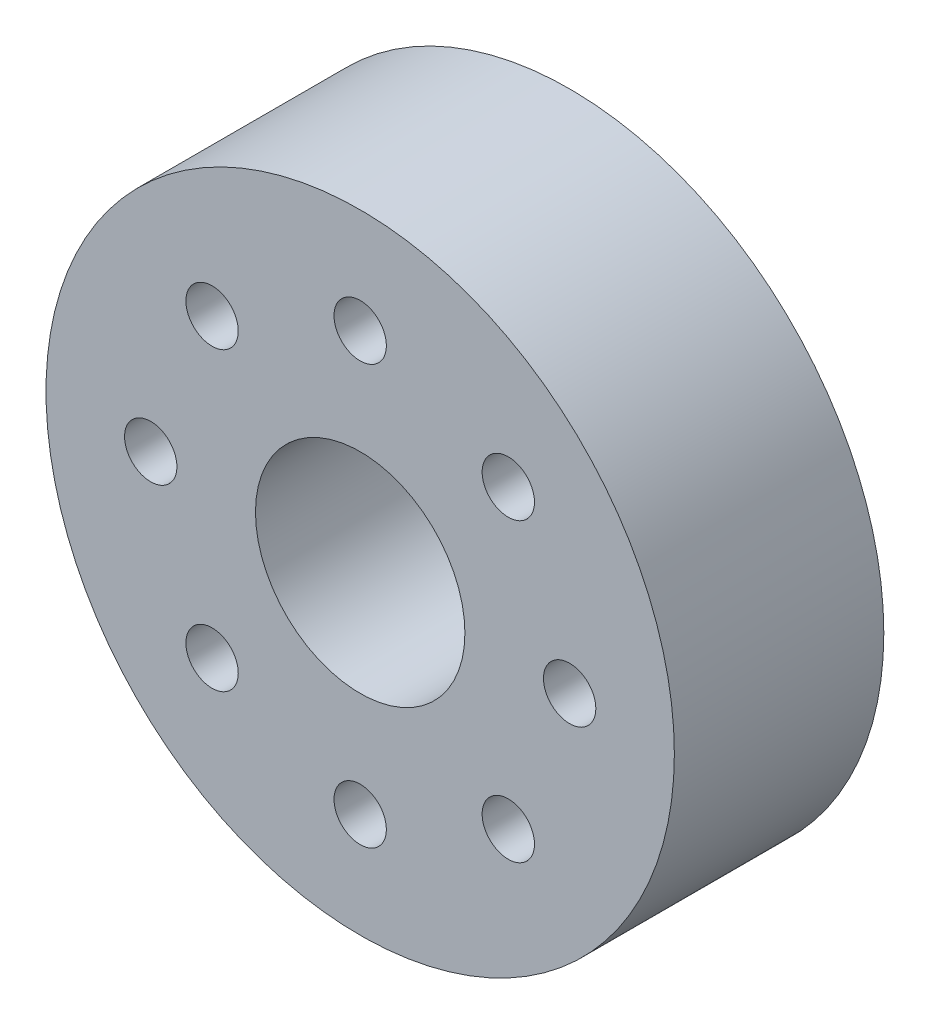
ISO-10303-21;
HEADER;
FILE_DESCRIPTION(('STEP AP214'),'2;1');
FILE_NAME('part.step','',(''),(''),'','','');
FILE_SCHEMA(('AUTOMOTIVE_DESIGN { 1 0 10303 214 1 1 1 1 }'));
ENDSEC;
DATA;
#1=APPLICATION_CONTEXT('core data for automotive mechanical design processes');
#2=APPLICATION_PROTOCOL_DEFINITION('international standard','automotive_design',2000,#1);
#3=PRODUCT_CONTEXT('',#1,'mechanical');
#4=PRODUCT('Part','Part','',(#3));
#5=PRODUCT_RELATED_PRODUCT_CATEGORY('part','',(#4));
#6=PRODUCT_DEFINITION_FORMATION('','',#4);
#7=PRODUCT_DEFINITION_CONTEXT('part definition',#1,'design');
#8=PRODUCT_DEFINITION('design','',#6,#7);
#9=PRODUCT_DEFINITION_SHAPE('','',#8);
#10=(LENGTH_UNIT() NAMED_UNIT(*) SI_UNIT(.MILLI.,.METRE.));
#11=(NAMED_UNIT(*) PLANE_ANGLE_UNIT() SI_UNIT($,.RADIAN.));
#12=(NAMED_UNIT(*) SI_UNIT($,.STERADIAN.) SOLID_ANGLE_UNIT());
#13=UNCERTAINTY_MEASURE_WITH_UNIT(LENGTH_MEASURE(1.E-05),#10,'distance_accuracy_value','');
#14=(GEOMETRIC_REPRESENTATION_CONTEXT(3) GLOBAL_UNCERTAINTY_ASSIGNED_CONTEXT((#13)) GLOBAL_UNIT_ASSIGNED_CONTEXT((#10,
#11,#12)) REPRESENTATION_CONTEXT('',''));
#15=CARTESIAN_POINT('',(0.,0.,0.));
#16=DIRECTION('',(0.,0.,1.));
#17=DIRECTION('',(1.,0.,0.));
#18=AXIS2_PLACEMENT_3D('',#15,#16,#17);
#19=CARTESIAN_POINT('',(0.,0.,8.));
#20=DIRECTION('',(0.,0.,1.));
#21=DIRECTION('',(1.,0.,0.));
#22=AXIS2_PLACEMENT_3D('',#19,#20,#21);
#23=PLANE('',#22);
#24=CARTESIAN_POINT('',(-8.,0.,8.));
#25=DIRECTION('',(0.,0.,1.));
#26=DIRECTION('',(1.,0.,0.));
#27=AXIS2_PLACEMENT_3D('',#24,#25,#26);
#28=CIRCLE('',#27,1.);
#29=CARTESIAN_POINT('',(-7.,0.,8.));
#30=VERTEX_POINT('',#29);
#31=EDGE_CURVE('E99',#30,#30,#28,.T.);
#32=ORIENTED_EDGE('',*,*,#31,.F.);
#33=EDGE_LOOP('',(#32));
#34=FACE_BOUND('',#33,.T.);
#35=CARTESIAN_POINT('',(-5.65685424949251,-5.65685424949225,8.));
#36=DIRECTION('',(0.,0.,1.));
#37=DIRECTION('',(1.,0.,0.));
#38=AXIS2_PLACEMENT_3D('',#35,#36,#37);
#39=CIRCLE('',#38,1.);
#40=CARTESIAN_POINT('',(-4.6568542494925,-5.65685424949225,8.));
#41=VERTEX_POINT('',#40);
#42=EDGE_CURVE('E91',#41,#41,#39,.T.);
#43=ORIENTED_EDGE('',*,*,#42,.F.);
#44=EDGE_LOOP('',(#43));
#45=FACE_BOUND('',#44,.T.);
#46=CARTESIAN_POINT('',(0.,-8.,8.));
#47=DIRECTION('',(0.,0.,1.));
#48=DIRECTION('',(1.,0.,0.));
#49=AXIS2_PLACEMENT_3D('',#46,#47,#48);
#50=CIRCLE('',#49,1.);
#51=CARTESIAN_POINT('',(0.999999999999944,-8.,8.));
#52=VERTEX_POINT('',#51);
#53=EDGE_CURVE('E83',#52,#52,#50,.T.);
#54=ORIENTED_EDGE('',*,*,#53,.F.);
#55=EDGE_LOOP('',(#54));
#56=FACE_BOUND('',#55,.T.);
#57=CARTESIAN_POINT('',(5.65685424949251,-5.65685424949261,8.));
#58=DIRECTION('',(0.,0.,1.));
#59=DIRECTION('',(1.,0.,0.));
#60=AXIS2_PLACEMENT_3D('',#57,#58,#59);
#61=CIRCLE('',#60,1.00000000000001);
#62=CARTESIAN_POINT('',(6.65685424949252,-5.65685424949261,8.));
#63=VERTEX_POINT('',#62);
#64=EDGE_CURVE('E74',#63,#63,#61,.T.);
#65=ORIENTED_EDGE('',*,*,#64,.F.);
#66=EDGE_LOOP('',(#65));
#67=FACE_BOUND('',#66,.T.);
#68=CARTESIAN_POINT('',(8.,0.,8.));
#69=DIRECTION('',(0.,0.,1.));
#70=DIRECTION('',(1.,0.,0.));
#71=AXIS2_PLACEMENT_3D('',#68,#69,#70);
#72=CIRCLE('',#71,1.);
#73=CARTESIAN_POINT('',(9.,0.,8.));
#74=VERTEX_POINT('',#73);
#75=EDGE_CURVE('E122',#74,#74,#72,.T.);
#76=ORIENTED_EDGE('',*,*,#75,.F.);
#77=EDGE_LOOP('',(#76));
#78=FACE_BOUND('',#77,.T.);
#79=CARTESIAN_POINT('',(5.65685424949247,5.65685424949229,8.));
#80=DIRECTION('',(0.,0.,1.));
#81=DIRECTION('',(1.,0.,0.));
#82=AXIS2_PLACEMENT_3D('',#79,#80,#81);
#83=CIRCLE('',#82,1.);
#84=CARTESIAN_POINT('',(6.65685424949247,5.65685424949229,8.));
#85=VERTEX_POINT('',#84);
#86=EDGE_CURVE('E114',#85,#85,#83,.T.);
#87=ORIENTED_EDGE('',*,*,#86,.F.);
#88=EDGE_LOOP('',(#87));
#89=FACE_BOUND('',#88,.T.);
#90=CARTESIAN_POINT('',(0.,8.,8.));
#91=DIRECTION('',(0.,0.,1.));
#92=DIRECTION('',(1.,0.,0.));
#93=AXIS2_PLACEMENT_3D('',#90,#91,#92);
#94=CIRCLE('',#93,1.);
#95=CARTESIAN_POINT('',(1.,8.,8.));
#96=VERTEX_POINT('',#95);
#97=EDGE_CURVE('E106',#96,#96,#94,.T.);
#98=ORIENTED_EDGE('',*,*,#97,.F.);
#99=EDGE_LOOP('',(#98));
#100=FACE_BOUND('',#99,.T.);
#101=CARTESIAN_POINT('',(-5.65685424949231,5.65685424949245,8.));
#102=DIRECTION('',(0.,0.,1.));
#103=DIRECTION('',(1.,0.,0.));
#104=AXIS2_PLACEMENT_3D('',#101,#102,#103);
#105=CIRCLE('',#104,1.);
#106=CARTESIAN_POINT('',(-4.65685424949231,5.65685424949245,8.));
#107=VERTEX_POINT('',#106);
#108=EDGE_CURVE('E66',#107,#107,#105,.T.);
#109=ORIENTED_EDGE('',*,*,#108,.F.);
#110=EDGE_LOOP('',(#109));
#111=FACE_BOUND('',#110,.T.);
#112=CARTESIAN_POINT('',(0.,0.,8.));
#113=DIRECTION('',(0.,0.,1.));
#114=DIRECTION('',(1.,0.,0.));
#115=AXIS2_PLACEMENT_3D('',#112,#113,#114);
#116=CIRCLE('',#115,12.);
#117=CARTESIAN_POINT('',(12.,0.,8.));
#118=VERTEX_POINT('',#117);
#119=EDGE_CURVE('E10',#118,#118,#116,.T.);
#120=ORIENTED_EDGE('',*,*,#119,.T.);
#121=EDGE_LOOP('',(#120));
#122=FACE_BOUND('',#121,.T.);
#123=CARTESIAN_POINT('',(0.,0.,8.));
#124=DIRECTION('',(0.,0.,1.));
#125=DIRECTION('',(1.,0.,0.));
#126=AXIS2_PLACEMENT_3D('',#123,#124,#125);
#127=CIRCLE('',#126,4.);
#128=CARTESIAN_POINT('',(4.,0.,8.));
#129=VERTEX_POINT('',#128);
#130=EDGE_CURVE('E56',#129,#129,#127,.T.);
#131=ORIENTED_EDGE('',*,*,#130,.F.);
#132=EDGE_LOOP('',(#131));
#133=FACE_BOUND('',#132,.T.);
#134=ADVANCED_FACE('F43',(#34,#45,#56,#67,#78,#89,#100,#111,#122,#133),#23,.T.);
#135=CARTESIAN_POINT('',(0.,0.,0.));
#136=DIRECTION('',(0.,0.,1.));
#137=DIRECTION('',(1.,0.,0.));
#138=AXIS2_PLACEMENT_3D('',#135,#136,#137);
#139=PLANE('',#138);
#140=CARTESIAN_POINT('',(-8.,0.,0.));
#141=DIRECTION('',(0.,0.,1.));
#142=DIRECTION('',(1.,0.,0.));
#143=AXIS2_PLACEMENT_3D('',#140,#141,#142);
#144=CIRCLE('',#143,1.);
#145=CARTESIAN_POINT('',(-7.,0.,0.));
#146=VERTEX_POINT('',#145);
#147=EDGE_CURVE('E70',#146,#146,#144,.T.);
#148=ORIENTED_EDGE('',*,*,#147,.T.);
#149=EDGE_LOOP('',(#148));
#150=FACE_BOUND('',#149,.T.);
#151=CARTESIAN_POINT('',(-5.65685424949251,-5.65685424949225,0.));
#152=DIRECTION('',(0.,0.,1.));
#153=DIRECTION('',(1.,0.,0.));
#154=AXIS2_PLACEMENT_3D('',#151,#152,#153);
#155=CIRCLE('',#154,1.);
#156=CARTESIAN_POINT('',(-4.6568542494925,-5.65685424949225,0.));
#157=VERTEX_POINT('',#156);
#158=EDGE_CURVE('E95',#157,#157,#155,.T.);
#159=ORIENTED_EDGE('',*,*,#158,.T.);
#160=EDGE_LOOP('',(#159));
#161=FACE_BOUND('',#160,.T.);
#162=CARTESIAN_POINT('',(0.,-8.,0.));
#163=DIRECTION('',(0.,0.,1.));
#164=DIRECTION('',(1.,0.,0.));
#165=AXIS2_PLACEMENT_3D('',#162,#163,#164);
#166=CIRCLE('',#165,1.);
#167=CARTESIAN_POINT('',(0.999999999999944,-8.,0.));
#168=VERTEX_POINT('',#167);
#169=EDGE_CURVE('E87',#168,#168,#166,.T.);
#170=ORIENTED_EDGE('',*,*,#169,.T.);
#171=EDGE_LOOP('',(#170));
#172=FACE_BOUND('',#171,.T.);
#173=CARTESIAN_POINT('',(5.65685424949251,-5.65685424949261,0.));
#174=DIRECTION('',(0.,0.,1.));
#175=DIRECTION('',(1.,0.,0.));
#176=AXIS2_PLACEMENT_3D('',#173,#174,#175);
#177=CIRCLE('',#176,1.00000000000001);
#178=CARTESIAN_POINT('',(6.65685424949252,-5.65685424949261,0.));
#179=VERTEX_POINT('',#178);
#180=EDGE_CURVE('E78',#179,#179,#177,.T.);
#181=ORIENTED_EDGE('',*,*,#180,.T.);
#182=EDGE_LOOP('',(#181));
#183=FACE_BOUND('',#182,.T.);
#184=CARTESIAN_POINT('',(8.,0.,0.));
#185=DIRECTION('',(0.,0.,1.));
#186=DIRECTION('',(1.,0.,0.));
#187=AXIS2_PLACEMENT_3D('',#184,#185,#186);
#188=CIRCLE('',#187,1.);
#189=CARTESIAN_POINT('',(9.,0.,0.));
#190=VERTEX_POINT('',#189);
#191=EDGE_CURVE('E79',#190,#190,#188,.T.);
#192=ORIENTED_EDGE('',*,*,#191,.T.);
#193=EDGE_LOOP('',(#192));
#194=FACE_BOUND('',#193,.T.);
#195=CARTESIAN_POINT('',(5.65685424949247,5.65685424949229,0.));
#196=DIRECTION('',(0.,0.,1.));
#197=DIRECTION('',(1.,0.,0.));
#198=AXIS2_PLACEMENT_3D('',#195,#196,#197);
#199=CIRCLE('',#198,1.);
#200=CARTESIAN_POINT('',(6.65685424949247,5.65685424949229,0.));
#201=VERTEX_POINT('',#200);
#202=EDGE_CURVE('E118',#201,#201,#199,.T.);
#203=ORIENTED_EDGE('',*,*,#202,.T.);
#204=EDGE_LOOP('',(#203));
#205=FACE_BOUND('',#204,.T.);
#206=CARTESIAN_POINT('',(0.,8.,0.));
#207=DIRECTION('',(0.,0.,1.));
#208=DIRECTION('',(1.,0.,0.));
#209=AXIS2_PLACEMENT_3D('',#206,#207,#208);
#210=CIRCLE('',#209,1.);
#211=CARTESIAN_POINT('',(1.,8.,0.));
#212=VERTEX_POINT('',#211);
#213=EDGE_CURVE('E110',#212,#212,#210,.T.);
#214=ORIENTED_EDGE('',*,*,#213,.T.);
#215=EDGE_LOOP('',(#214));
#216=FACE_BOUND('',#215,.T.);
#217=CARTESIAN_POINT('',(-5.65685424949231,5.65685424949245,0.));
#218=DIRECTION('',(0.,0.,1.));
#219=DIRECTION('',(1.,0.,0.));
#220=AXIS2_PLACEMENT_3D('',#217,#218,#219);
#221=CIRCLE('',#220,1.);
#222=CARTESIAN_POINT('',(-4.65685424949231,5.65685424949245,0.));
#223=VERTEX_POINT('',#222);
#224=EDGE_CURVE('E62',#223,#223,#221,.T.);
#225=ORIENTED_EDGE('',*,*,#224,.T.);
#226=EDGE_LOOP('',(#225));
#227=FACE_BOUND('',#226,.T.);
#228=CARTESIAN_POINT('',(0.,0.,0.));
#229=DIRECTION('',(0.,0.,1.));
#230=DIRECTION('',(1.,0.,0.));
#231=AXIS2_PLACEMENT_3D('',#228,#229,#230);
#232=CIRCLE('',#231,12.);
#233=CARTESIAN_POINT('',(12.,0.,0.));
#234=VERTEX_POINT('',#233);
#235=EDGE_CURVE('E47',#234,#234,#232,.T.);
#236=ORIENTED_EDGE('',*,*,#235,.F.);
#237=EDGE_LOOP('',(#236));
#238=FACE_BOUND('',#237,.T.);
#239=CARTESIAN_POINT('',(0.,0.,0.));
#240=DIRECTION('',(0.,0.,1.));
#241=DIRECTION('',(1.,0.,0.));
#242=AXIS2_PLACEMENT_3D('',#239,#240,#241);
#243=CIRCLE('',#242,4.);
#244=CARTESIAN_POINT('',(4.,0.,0.));
#245=VERTEX_POINT('',#244);
#246=EDGE_CURVE('E58',#245,#245,#243,.T.);
#247=ORIENTED_EDGE('',*,*,#246,.T.);
#248=EDGE_LOOP('',(#247));
#249=FACE_BOUND('',#248,.T.);
#250=ADVANCED_FACE('F130',(#150,#161,#172,#183,#194,#205,#216,#227,#238,#249),#139,.F.);
#251=CARTESIAN_POINT('',(0.,0.,8.));
#252=DIRECTION('',(0.,0.,-1.));
#253=DIRECTION('',(-1.,0.,0.));
#254=AXIS2_PLACEMENT_3D('',#251,#252,#253);
#255=CYLINDRICAL_SURFACE('',#254,12.);
#256=ORIENTED_EDGE('',*,*,#119,.F.);
#257=EDGE_LOOP('',(#256));
#258=FACE_BOUND('',#257,.T.);
#259=ORIENTED_EDGE('',*,*,#235,.T.);
#260=EDGE_LOOP('',(#259));
#261=FACE_BOUND('',#260,.T.);
#262=ADVANCED_FACE('F45',(#258,#261),#255,.T.);
#263=CARTESIAN_POINT('',(0.,0.,8.));
#264=DIRECTION('',(0.,0.,-1.));
#265=DIRECTION('',(-1.,0.,0.));
#266=AXIS2_PLACEMENT_3D('',#263,#264,#265);
#267=CYLINDRICAL_SURFACE('',#266,4.);
#268=ORIENTED_EDGE('',*,*,#130,.T.);
#269=EDGE_LOOP('',(#268));
#270=FACE_BOUND('',#269,.T.);
#271=ORIENTED_EDGE('',*,*,#246,.F.);
#272=EDGE_LOOP('',(#271));
#273=FACE_BOUND('',#272,.T.);
#274=ADVANCED_FACE('F153',(#270,#273),#267,.F.);
#275=CARTESIAN_POINT('',(-5.65685424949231,5.65685424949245,0.));
#276=DIRECTION('',(0.,0.,1.));
#277=DIRECTION('',(1.,0.,0.));
#278=AXIS2_PLACEMENT_3D('',#275,#276,#277);
#279=CYLINDRICAL_SURFACE('',#278,1.);
#280=ORIENTED_EDGE('',*,*,#224,.F.);
#281=EDGE_LOOP('',(#280));
#282=FACE_BOUND('',#281,.T.);
#283=ORIENTED_EDGE('',*,*,#108,.T.);
#284=EDGE_LOOP('',(#283));
#285=FACE_BOUND('',#284,.T.);
#286=ADVANCED_FACE('F156',(#282,#285),#279,.F.);
#287=CARTESIAN_POINT('',(0.,8.,0.));
#288=DIRECTION('',(0.,0.,1.));
#289=DIRECTION('',(1.,0.,0.));
#290=AXIS2_PLACEMENT_3D('',#287,#288,#289);
#291=CYLINDRICAL_SURFACE('',#290,1.);
#292=ORIENTED_EDGE('',*,*,#213,.F.);
#293=EDGE_LOOP('',(#292));
#294=FACE_BOUND('',#293,.T.);
#295=ORIENTED_EDGE('',*,*,#97,.T.);
#296=EDGE_LOOP('',(#295));
#297=FACE_BOUND('',#296,.T.);
#298=ADVANCED_FACE('F170',(#294,#297),#291,.F.);
#299=CARTESIAN_POINT('',(5.65685424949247,5.65685424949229,0.));
#300=DIRECTION('',(0.,0.,1.));
#301=DIRECTION('',(1.,0.,0.));
#302=AXIS2_PLACEMENT_3D('',#299,#300,#301);
#303=CYLINDRICAL_SURFACE('',#302,1.);
#304=ORIENTED_EDGE('',*,*,#202,.F.);
#305=EDGE_LOOP('',(#304));
#306=FACE_BOUND('',#305,.T.);
#307=ORIENTED_EDGE('',*,*,#86,.T.);
#308=EDGE_LOOP('',(#307));
#309=FACE_BOUND('',#308,.T.);
#310=ADVANCED_FACE('F137',(#306,#309),#303,.F.);
#311=CARTESIAN_POINT('',(8.,0.,0.));
#312=DIRECTION('',(0.,0.,1.));
#313=DIRECTION('',(1.,0.,0.));
#314=AXIS2_PLACEMENT_3D('',#311,#312,#313);
#315=CYLINDRICAL_SURFACE('',#314,1.);
#316=ORIENTED_EDGE('',*,*,#191,.F.);
#317=EDGE_LOOP('',(#316));
#318=FACE_BOUND('',#317,.T.);
#319=ORIENTED_EDGE('',*,*,#75,.T.);
#320=EDGE_LOOP('',(#319));
#321=FACE_BOUND('',#320,.T.);
#322=ADVANCED_FACE('F133',(#318,#321),#315,.F.);
#323=CARTESIAN_POINT('',(5.65685424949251,-5.65685424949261,0.));
#324=DIRECTION('',(0.,0.,1.));
#325=DIRECTION('',(1.,0.,0.));
#326=AXIS2_PLACEMENT_3D('',#323,#324,#325);
#327=CYLINDRICAL_SURFACE('',#326,1.00000000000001);
#328=ORIENTED_EDGE('',*,*,#180,.F.);
#329=EDGE_LOOP('',(#328));
#330=FACE_BOUND('',#329,.T.);
#331=ORIENTED_EDGE('',*,*,#64,.T.);
#332=EDGE_LOOP('',(#331));
#333=FACE_BOUND('',#332,.T.);
#334=ADVANCED_FACE('F136',(#330,#333),#327,.F.);
#335=CARTESIAN_POINT('',(0.,-8.,0.));
#336=DIRECTION('',(0.,0.,1.));
#337=DIRECTION('',(1.,0.,0.));
#338=AXIS2_PLACEMENT_3D('',#335,#336,#337);
#339=CYLINDRICAL_SURFACE('',#338,1.);
#340=ORIENTED_EDGE('',*,*,#169,.F.);
#341=EDGE_LOOP('',(#340));
#342=FACE_BOUND('',#341,.T.);
#343=ORIENTED_EDGE('',*,*,#53,.T.);
#344=EDGE_LOOP('',(#343));
#345=FACE_BOUND('',#344,.T.);
#346=ADVANCED_FACE('F174',(#342,#345),#339,.F.);
#347=CARTESIAN_POINT('',(-5.65685424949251,-5.65685424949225,0.));
#348=DIRECTION('',(0.,0.,1.));
#349=DIRECTION('',(1.,0.,0.));
#350=AXIS2_PLACEMENT_3D('',#347,#348,#349);
#351=CYLINDRICAL_SURFACE('',#350,1.);
#352=ORIENTED_EDGE('',*,*,#158,.F.);
#353=EDGE_LOOP('',(#352));
#354=FACE_BOUND('',#353,.T.);
#355=ORIENTED_EDGE('',*,*,#42,.T.);
#356=EDGE_LOOP('',(#355));
#357=FACE_BOUND('',#356,.T.);
#358=ADVANCED_FACE('F178',(#354,#357),#351,.F.);
#359=CARTESIAN_POINT('',(-8.,0.,0.));
#360=DIRECTION('',(0.,0.,1.));
#361=DIRECTION('',(1.,0.,0.));
#362=AXIS2_PLACEMENT_3D('',#359,#360,#361);
#363=CYLINDRICAL_SURFACE('',#362,1.);
#364=ORIENTED_EDGE('',*,*,#147,.F.);
#365=EDGE_LOOP('',(#364));
#366=FACE_BOUND('',#365,.T.);
#367=ORIENTED_EDGE('',*,*,#31,.T.);
#368=EDGE_LOOP('',(#367));
#369=FACE_BOUND('',#368,.T.);
#370=ADVANCED_FACE('F182',(#366,#369),#363,.F.);
#371=CLOSED_SHELL('',(#134,#250,#262,#274,#286,#298,#310,#322,#334,#346,#358,#370));
#372=MANIFOLD_SOLID_BREP('B2',#371);
#373=ADVANCED_BREP_SHAPE_REPRESENTATION('',(#18,#372),#14);
#374=SHAPE_DEFINITION_REPRESENTATION(#9,#373);
ENDSEC;
END-ISO-10303-21;
